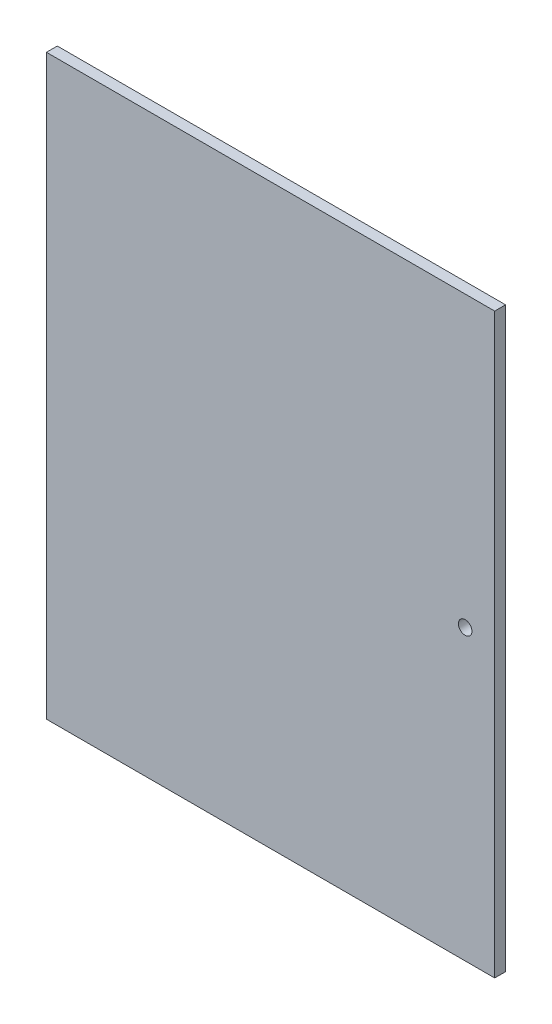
ISO-10303-21;
HEADER;
FILE_DESCRIPTION(('STEP AP214'),'2;1');
FILE_NAME('part.step','',(''),(''),'','','');
FILE_SCHEMA(('AUTOMOTIVE_DESIGN { 1 0 10303 214 1 1 1 1 }'));
ENDSEC;
DATA;
#1=APPLICATION_CONTEXT('core data for automotive mechanical design processes');
#2=APPLICATION_PROTOCOL_DEFINITION('international standard','automotive_design',2000,#1);
#3=PRODUCT_CONTEXT('',#1,'mechanical');
#4=PRODUCT('Part','Part','',(#3));
#5=PRODUCT_RELATED_PRODUCT_CATEGORY('part','',(#4));
#6=PRODUCT_DEFINITION_FORMATION('','',#4);
#7=PRODUCT_DEFINITION_CONTEXT('part definition',#1,'design');
#8=PRODUCT_DEFINITION('design','',#6,#7);
#9=PRODUCT_DEFINITION_SHAPE('','',#8);
#10=(LENGTH_UNIT() NAMED_UNIT(*) SI_UNIT(.MILLI.,.METRE.));
#11=(NAMED_UNIT(*) PLANE_ANGLE_UNIT() SI_UNIT($,.RADIAN.));
#12=(NAMED_UNIT(*) SI_UNIT($,.STERADIAN.) SOLID_ANGLE_UNIT());
#13=UNCERTAINTY_MEASURE_WITH_UNIT(LENGTH_MEASURE(1.E-05),#10,'distance_accuracy_value','');
#14=(GEOMETRIC_REPRESENTATION_CONTEXT(3) GLOBAL_UNCERTAINTY_ASSIGNED_CONTEXT((#13)) GLOBAL_UNIT_ASSIGNED_CONTEXT((#10,
#11,#12)) REPRESENTATION_CONTEXT('',''));
#15=CARTESIAN_POINT('',(0.,0.,0.));
#16=DIRECTION('',(0.,0.,1.));
#17=DIRECTION('',(1.,0.,0.));
#18=AXIS2_PLACEMENT_3D('',#15,#16,#17);
#19=CARTESIAN_POINT('',(0.,0.,16.));
#20=DIRECTION('',(0.,0.,1.));
#21=DIRECTION('',(1.,0.,0.));
#22=AXIS2_PLACEMENT_3D('',#19,#20,#21);
#23=PLANE('',#22);
#24=DIRECTION('',(0.,1.,0.));
#25=VECTOR('',#24,1.);
#26=CARTESIAN_POINT('',(330.2,425.45,16.));
#27=LINE('',#26,#25);
#28=CARTESIAN_POINT('',(330.2,-425.45,16.));
#29=VERTEX_POINT('',#28);
#30=CARTESIAN_POINT('',(330.2,425.45,16.));
#31=VERTEX_POINT('',#30);
#32=EDGE_CURVE('E86',#29,#31,#27,.T.);
#33=ORIENTED_EDGE('',*,*,#32,.T.);
#34=DIRECTION('',(-1.,0.,0.));
#35=VECTOR('',#34,1.);
#36=CARTESIAN_POINT('',(-330.2,425.45,16.));
#37=LINE('',#36,#35);
#38=CARTESIAN_POINT('',(-330.2,425.45,16.));
#39=VERTEX_POINT('',#38);
#40=EDGE_CURVE('E81',#31,#39,#37,.T.);
#41=ORIENTED_EDGE('',*,*,#40,.T.);
#42=DIRECTION('',(0.,-1.,0.));
#43=VECTOR('',#42,1.);
#44=CARTESIAN_POINT('',(-330.2,425.45,16.));
#45=LINE('',#44,#43);
#46=CARTESIAN_POINT('',(-330.2,-425.45,16.));
#47=VERTEX_POINT('',#46);
#48=EDGE_CURVE('E84',#39,#47,#45,.T.);
#49=ORIENTED_EDGE('',*,*,#48,.T.);
#50=DIRECTION('',(1.,0.,0.));
#51=VECTOR('',#50,1.);
#52=CARTESIAN_POINT('',(-330.2,-425.45,16.));
#53=LINE('',#52,#51);
#54=EDGE_CURVE('E51',#47,#29,#53,.T.);
#55=ORIENTED_EDGE('',*,*,#54,.T.);
#56=EDGE_LOOP('',(#33,#41,#49,#55));
#57=FACE_BOUND('',#56,.T.);
#58=CARTESIAN_POINT('',(286.7,0.,16.));
#59=DIRECTION('',(0.,0.,1.));
#60=DIRECTION('',(1.,0.,0.));
#61=AXIS2_PLACEMENT_3D('',#58,#59,#60);
#62=CIRCLE('',#61,9.99999999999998);
#63=CARTESIAN_POINT('',(296.7,0.,16.));
#64=VERTEX_POINT('',#63);
#65=EDGE_CURVE('E101',#64,#64,#62,.T.);
#66=ORIENTED_EDGE('',*,*,#65,.F.);
#67=EDGE_LOOP('',(#66));
#68=FACE_BOUND('',#67,.T.);
#69=ADVANCED_FACE('F34',(#57,#68),#23,.T.);
#70=CARTESIAN_POINT('',(0.,0.,0.));
#71=DIRECTION('',(0.,0.,1.));
#72=DIRECTION('',(1.,0.,0.));
#73=AXIS2_PLACEMENT_3D('',#70,#71,#72);
#74=PLANE('',#73);
#75=DIRECTION('',(0.,1.,0.));
#76=VECTOR('',#75,1.);
#77=CARTESIAN_POINT('',(330.2,425.45,0.));
#78=LINE('',#77,#76);
#79=CARTESIAN_POINT('',(330.2,-425.45,0.));
#80=VERTEX_POINT('',#79);
#81=CARTESIAN_POINT('',(330.2,425.45,0.));
#82=VERTEX_POINT('',#81);
#83=EDGE_CURVE('E98',#80,#82,#78,.T.);
#84=ORIENTED_EDGE('',*,*,#83,.F.);
#85=DIRECTION('',(1.,0.,0.));
#86=VECTOR('',#85,1.);
#87=CARTESIAN_POINT('',(-330.2,-425.45,0.));
#88=LINE('',#87,#86);
#89=CARTESIAN_POINT('',(-330.2,-425.45,0.));
#90=VERTEX_POINT('',#89);
#91=EDGE_CURVE('E74',#90,#80,#88,.T.);
#92=ORIENTED_EDGE('',*,*,#91,.F.);
#93=DIRECTION('',(0.,-1.,0.));
#94=VECTOR('',#93,1.);
#95=CARTESIAN_POINT('',(-330.2,425.45,0.));
#96=LINE('',#95,#94);
#97=CARTESIAN_POINT('',(-330.2,425.45,0.));
#98=VERTEX_POINT('',#97);
#99=EDGE_CURVE('E68',#98,#90,#96,.T.);
#100=ORIENTED_EDGE('',*,*,#99,.F.);
#101=DIRECTION('',(-1.,0.,0.));
#102=VECTOR('',#101,1.);
#103=CARTESIAN_POINT('',(-330.2,425.45,0.));
#104=LINE('',#103,#102);
#105=EDGE_CURVE('E90',#82,#98,#104,.T.);
#106=ORIENTED_EDGE('',*,*,#105,.F.);
#107=EDGE_LOOP('',(#84,#92,#100,#106));
#108=FACE_BOUND('',#107,.T.);
#109=CARTESIAN_POINT('',(286.7,0.,0.));
#110=DIRECTION('',(0.,0.,1.));
#111=DIRECTION('',(1.,0.,0.));
#112=AXIS2_PLACEMENT_3D('',#109,#110,#111);
#113=CIRCLE('',#112,9.99999999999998);
#114=CARTESIAN_POINT('',(296.7,0.,0.));
#115=VERTEX_POINT('',#114);
#116=EDGE_CURVE('E113',#115,#115,#113,.T.);
#117=ORIENTED_EDGE('',*,*,#116,.T.);
#118=EDGE_LOOP('',(#117));
#119=FACE_BOUND('',#118,.T.);
#120=ADVANCED_FACE('F109',(#108,#119),#74,.F.);
#121=CARTESIAN_POINT('',(330.2,425.45,16.));
#122=DIRECTION('',(-1.,0.,0.));
#123=DIRECTION('',(0.,-1.,0.));
#124=AXIS2_PLACEMENT_3D('',#121,#122,#123);
#125=PLANE('',#124);
#126=ORIENTED_EDGE('',*,*,#83,.T.);
#127=DIRECTION('',(0.,0.,-1.));
#128=VECTOR('',#127,1.);
#129=CARTESIAN_POINT('',(330.2,425.45,16.));
#130=LINE('',#129,#128);
#131=EDGE_CURVE('E11',#31,#82,#130,.T.);
#132=ORIENTED_EDGE('',*,*,#131,.F.);
#133=ORIENTED_EDGE('',*,*,#32,.F.);
#134=DIRECTION('',(0.,0.,-1.));
#135=VECTOR('',#134,1.);
#136=CARTESIAN_POINT('',(330.2,-425.45,16.));
#137=LINE('',#136,#135);
#138=EDGE_CURVE('E94',#29,#80,#137,.T.);
#139=ORIENTED_EDGE('',*,*,#138,.T.);
#140=EDGE_LOOP('',(#126,#132,#133,#139));
#141=FACE_BOUND('',#140,.T.);
#142=ADVANCED_FACE('F36',(#141),#125,.F.);
#143=CARTESIAN_POINT('',(-330.2,425.45,16.));
#144=DIRECTION('',(0.,-1.,0.));
#145=DIRECTION('',(0.,0.,-1.));
#146=AXIS2_PLACEMENT_3D('',#143,#144,#145);
#147=PLANE('',#146);
#148=ORIENTED_EDGE('',*,*,#105,.T.);
#149=DIRECTION('',(0.,0.,-1.));
#150=VECTOR('',#149,1.);
#151=CARTESIAN_POINT('',(-330.2,425.45,16.));
#152=LINE('',#151,#150);
#153=EDGE_CURVE('E43',#39,#98,#152,.T.);
#154=ORIENTED_EDGE('',*,*,#153,.F.);
#155=ORIENTED_EDGE('',*,*,#40,.F.);
#156=ORIENTED_EDGE('',*,*,#131,.T.);
#157=EDGE_LOOP('',(#148,#154,#155,#156));
#158=FACE_BOUND('',#157,.T.);
#159=ADVANCED_FACE('F89',(#158),#147,.F.);
#160=CARTESIAN_POINT('',(-330.2,425.45,16.));
#161=DIRECTION('',(1.,0.,0.));
#162=DIRECTION('',(0.,1.,0.));
#163=AXIS2_PLACEMENT_3D('',#160,#161,#162);
#164=PLANE('',#163);
#165=ORIENTED_EDGE('',*,*,#99,.T.);
#166=DIRECTION('',(0.,0.,-1.));
#167=VECTOR('',#166,1.);
#168=CARTESIAN_POINT('',(-330.2,-425.45,16.));
#169=LINE('',#168,#167);
#170=EDGE_CURVE('E91',#47,#90,#169,.T.);
#171=ORIENTED_EDGE('',*,*,#170,.F.);
#172=ORIENTED_EDGE('',*,*,#48,.F.);
#173=ORIENTED_EDGE('',*,*,#153,.T.);
#174=EDGE_LOOP('',(#165,#171,#172,#173));
#175=FACE_BOUND('',#174,.T.);
#176=ADVANCED_FACE('F92',(#175),#164,.F.);
#177=CARTESIAN_POINT('',(-330.2,-425.45,16.));
#178=DIRECTION('',(0.,1.,0.));
#179=DIRECTION('',(0.,0.,1.));
#180=AXIS2_PLACEMENT_3D('',#177,#178,#179);
#181=PLANE('',#180);
#182=ORIENTED_EDGE('',*,*,#91,.T.);
#183=ORIENTED_EDGE('',*,*,#138,.F.);
#184=ORIENTED_EDGE('',*,*,#54,.F.);
#185=ORIENTED_EDGE('',*,*,#170,.T.);
#186=EDGE_LOOP('',(#182,#183,#184,#185));
#187=FACE_BOUND('',#186,.T.);
#188=ADVANCED_FACE('F106',(#187),#181,.F.);
#189=CARTESIAN_POINT('',(286.7,0.,16.));
#190=DIRECTION('',(0.,0.,-1.));
#191=DIRECTION('',(-1.,0.,0.));
#192=AXIS2_PLACEMENT_3D('',#189,#190,#191);
#193=CYLINDRICAL_SURFACE('',#192,9.99999999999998);
#194=ORIENTED_EDGE('',*,*,#65,.T.);
#195=EDGE_LOOP('',(#194));
#196=FACE_BOUND('',#195,.T.);
#197=ORIENTED_EDGE('',*,*,#116,.F.);
#198=EDGE_LOOP('',(#197));
#199=FACE_BOUND('',#198,.T.);
#200=ADVANCED_FACE('F119',(#196,#199),#193,.F.);
#201=CLOSED_SHELL('',(#69,#120,#142,#159,#176,#188,#200));
#202=MANIFOLD_SOLID_BREP('B2',#201);
#203=ADVANCED_BREP_SHAPE_REPRESENTATION('',(#18,#202),#14);
#204=SHAPE_DEFINITION_REPRESENTATION(#9,#203);
ENDSEC;
END-ISO-10303-21;
